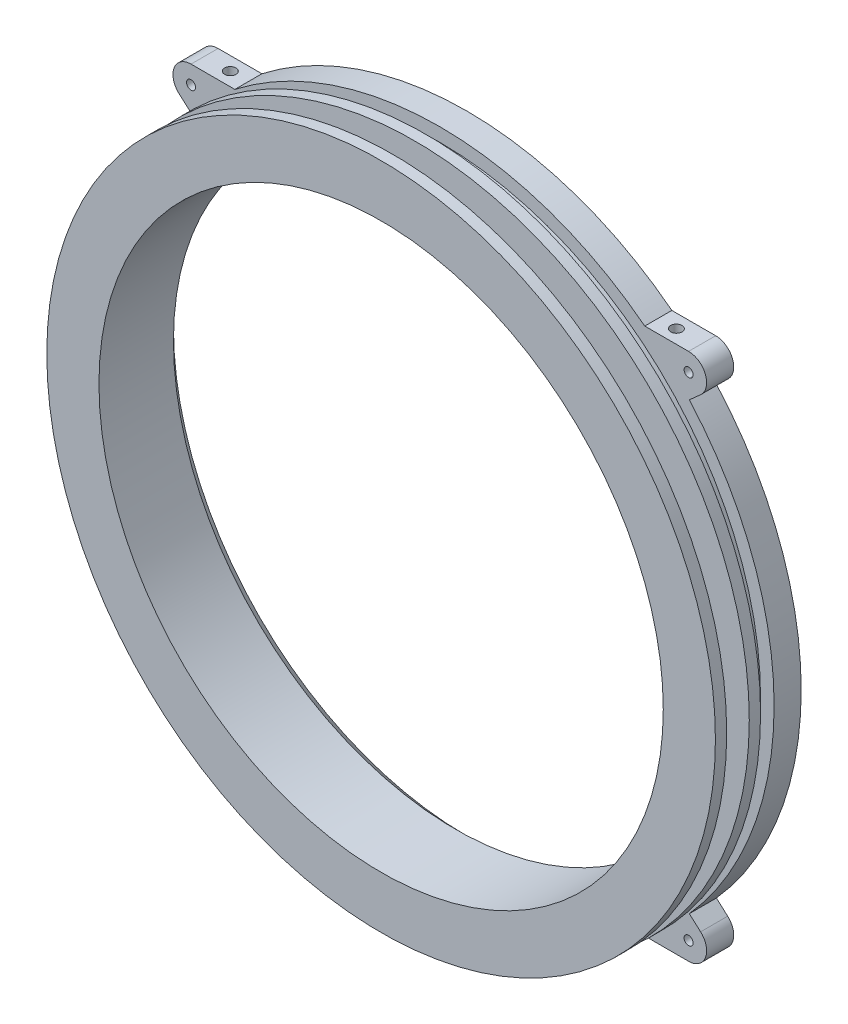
from build123d import *

# Parameters (mm, degrees)
SKETCH_1_R               = 148.1
SKETCH_1_R_2             = 125
EXTRUDE_1_DEPTH          = 12
SKETCH_2_R               = 142.1
SKETCH_2_R_2             = 125
EXTRUDE_2_DEPTH          = 6
SKETCH_3_R               = 148.1
SKETCH_3_R_2             = 125
EXTRUDE_3_DEPTH          = 5
SKETCH_4_R               = 133.1
SKETCH_4_R_2             = 125
EXTRUDE_4_DEPTH          = 10
SKETCH_5_R               = 148.1
SKETCH_5_R_2             = 125
EXTRUDE_5_DEPTH          = 5
SKETCH_6_R               = 2
EXTRUDE_6_DEPTH          = 12
SKETCH_7_R               = 2.5
CUT_EXTRUDE_1_DEPTH      = 15
MIRROR_2_COPY_1_SKETCH_R = 2.5
MIRROR_2_COPY_1_DEPTH    = 15
CHAMFER_1_SIZE           = 5


with BuildPart() as part:
    # Sketch 1 → Extrude 1 (new body)
    with BuildSketch(Plane.XY):
        Circle(SKETCH_1_R)
        Circle(SKETCH_1_R_2, mode=Mode.SUBTRACT)
    extrude(amount=EXTRUDE_1_DEPTH)

    # Sketch 2 → Extrude 2 (add)
    with BuildSketch(Plane.XY.offset(12)):
        Circle(SKETCH_2_R)
        Circle(SKETCH_2_R_2, mode=Mode.SUBTRACT)
    extrude(amount=EXTRUDE_2_DEPTH)

    # Sketch 3 → Extrude 3 (add)
    with BuildSketch(Plane.XY.offset(18)):
        Circle(SKETCH_3_R)
        Circle(SKETCH_3_R_2, mode=Mode.SUBTRACT)
    extrude(amount=EXTRUDE_3_DEPTH)

    # Sketch 4 → Extrude 4 (add)
    with BuildSketch(Plane.XY.offset(23)):
        Circle(SKETCH_4_R)
        Circle(SKETCH_4_R_2, mode=Mode.SUBTRACT)
    extrude(amount=EXTRUDE_4_DEPTH)

    # Sketch 5 → Extrude 5 (add)
    with BuildSketch(Plane.XY.offset(33)):
        Circle(SKETCH_5_R)
        Circle(SKETCH_5_R_2, mode=Mode.SUBTRACT)
    extrude(amount=EXTRUDE_5_DEPTH)

    # Sketch 6 → Extrude 6 (add)
    # profile 1 of 4: a face of its own
    with BuildSketch(Plane.XY):
        with BuildLine():
            Line((-90.799834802, 117), (-110.208193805, 117))
            ThreePointArc((-110.208193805, 117), (-117.683675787, 111.849064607), (-115.532726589, 103.029292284))
            Line((-115.532726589, 103.029292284), (-110.532726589, 98.570413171))
            ThreePointArc((-110.532726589, 98.570413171), (-101.087152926, 108.235842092), (-90.799834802, 117))
        make_face()
        with Locations((-110.208193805, 109)):
            Circle(SKETCH_6_R, mode=Mode.SUBTRACT)
    # profile 2 of 4: a face of its own
    with BuildSketch(Plane.XY):
        with BuildLine():
            Line((115.532726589, 103.029292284), (110.532726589, 98.570413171))
            ThreePointArc((110.532726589, 98.570413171), (101.087152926, 108.235842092), (90.799834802, 117))
            Line((90.799834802, 117), (110.208193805, 117))
            ThreePointArc((110.208193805, 117), (117.683675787, 111.849064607), (115.532726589, 103.029292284))
        make_face()
        with Locations(Location((110.208193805, 109, 0), (0, 0, 180))):
            Circle(SKETCH_6_R, mode=Mode.SUBTRACT)
    # profile 3 of 4: a face of its own
    with BuildSketch(Plane.XY):
        with BuildLine():
            Line((115.532726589, -103.029292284), (110.532726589, -98.570413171))
            ThreePointArc((110.532726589, -98.570413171), (101.087152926, -108.235842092), (90.799834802, -117))
            Line((90.799834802, -117), (110.208193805, -117))
            ThreePointArc((110.208193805, -117), (117.683675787, -111.849064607), (115.532726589, -103.029292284))
        make_face()
        with Locations((110.208193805, -109)):
            Circle(SKETCH_6_R, mode=Mode.SUBTRACT)
    # profile 4 of 4: a face of its own
    with BuildSketch(Plane.XY):
        with BuildLine():
            Line((-115.532726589, -103.029292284), (-110.532726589, -98.570413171))
            ThreePointArc((-110.532726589, -98.570413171), (-101.087152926, -108.235842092), (-90.799834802, -117))
            Line((-90.799834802, -117), (-110.208193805, -117))
            ThreePointArc((-110.208193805, -117), (-117.683675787, -111.849064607), (-115.532726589, -103.029292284))
        make_face()
        with Locations(Location((-110.208193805, -109, 0), (0, 0, 180))):
            Circle(SKETCH_6_R, mode=Mode.SUBTRACT)
    extrude(amount=EXTRUDE_6_DEPTH)

    # Sketch 7 → Cut-Extrude 1 (cut)
    with BuildSketch(Plane(origin=(0, 117, 0), x_dir=(1, 0, 0), z_dir=(0, 1, 0))):
        with Locations(Location((-98.799834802, -6, 0), (0, 0, 270))):
            Circle(SKETCH_7_R)
    cut_extrude_1 = extrude(amount=-CUT_EXTRUDE_1_DEPTH, mode=Mode.SUBTRACT)

    # Mirror 1: Cut-Extrude 1 across plane
    add(cut_extrude_1.mirror(Plane(origin=(0, 0, 0), x_dir=(0, 0, 1), z_dir=(1, 0, 0))), mode=Mode.SUBTRACT)

    # Mirror 2: Cut-Extrude 1 across plane
    add(cut_extrude_1.mirror(Plane.ZX), mode=Mode.SUBTRACT)

    # Mirror 2 copy 1 sketch → Mirror 2 copy 1 (cut)
    with BuildSketch(Plane(origin=(0, -117, 0), x_dir=(-1, 0, 0), z_dir=(0, -1, 0))):
        with Locations(Location((-98.799834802, -6, 0), (0, 0, 270))):
            Circle(MIRROR_2_COPY_1_SKETCH_R)
    extrude(amount=-MIRROR_2_COPY_1_DEPTH, mode=Mode.SUBTRACT)

    # Chamfer 1
    chamfer_1_edges = [part.edges().sort_by_distance(p)[0] for p in [
        (-125, 0, 0),
    ]]
    chamfer(chamfer_1_edges, length=CHAMFER_1_SIZE)


solid = part.part
